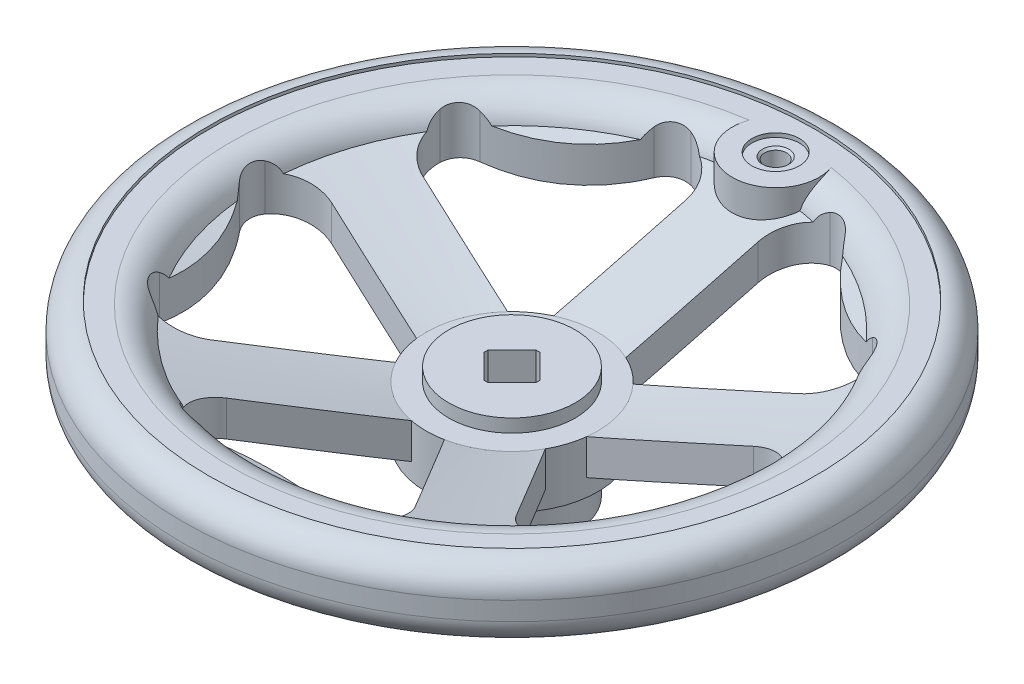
from build123d import *

# Parameters (mm, degrees)
CUT_EXTRUDE1_DEPTH = 65.5
CUT_EXTRUDE2_DEPTH = 65.5
CUT_EXTRUDE3_DEPTH = 65.5
CUT_EXTRUDE4_DEPTH = 65.5
CUT_EXTRUDE5_DEPTH = 65.5
SKETCH7_W          = 32.5
SKETCH7_H          = 20
SKETCH8_W          = 16.5
SKETCH8_H          = 24
SKETCH9_W          = 9
SKETCH9_H          = 1.5
CUT_EXTRUDE6_DEPTH = 44


with BuildPart() as part:
    # Sketch1 → Revolve1 (revolve)
    with BuildSketch(Plane.XY, mode=Mode.PRIVATE) as revolve1_sk:
        with BuildLine():
            Line((0, 44), (24, 44))
            Line((24, 44), (24, 36.722431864))
            Line((24, 36.722431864), (95.15298206, 55.787815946))
            ThreePointArc((95.15298206, 55.787815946), (99.482496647, 61.974286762), (106.65, 64.35))
            Line((106.65, 64.35), (115, 64.35))
            Line((115, 64.35), (115, 65.5))
            ThreePointArc((115, 65.5), (122.071067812, 62.571067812), (125, 55.5))
            Line((125, 55.5), (125, 48.5))
            ThreePointArc((125, 48.5), (122.071067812, 41.428932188), (115, 38.5))
            Line((115, 38.5), (115, 40.35))
            Line((115, 40.35), (105.77, 40.35))
            ThreePointArc((105.77, 40.35), (104.493552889, 40.515676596), (103.301696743, 41.001726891))
            Line((103.301696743, 41.001726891), (99.1, 43.386825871))
            Line((99.1, 43.386825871), (24, 23.263841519))
            Line((24, 23.263841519), (24, 1.5))
            Line((24, 1.5), (22.5, 0))
            Line((22.5, 0), (0, 0))
            Line((0, 0), (0, 44))
        make_face()
    revolve(revolve1_sk.sketch.rotate(Axis((0, 0, 0), (0, 1, 0)), 270), axis=Axis((0, 0, 0), (0, 1, 0)))

    # Sketch2 → Cut-Extrude1 (cut)
    with BuildSketch(Plane(origin=(0, 0, 0), x_dir=(1, 0, 0), z_dir=(0, 1, 0))):
        with BuildLine():
            Line((35.753325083, -72.518062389), (5.914643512, -31.448640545))
            ThreePointArc((5.914643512, -31.448640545), (0, -32), (-5.914643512, -31.448640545))
            Line((-5.914643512, -31.448640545), (-35.753325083, -72.518062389))
            ThreePointArc((-35.753325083, -72.518062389), (-38.445307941, -82.449754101), (-34.104010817, -91.779191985))
            ThreePointArc((-34.104010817, -91.779191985), (-29.219082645, -94.46489837), (-23.655336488, -94.118097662))
            ThreePointArc((-23.655336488, -94.118097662), (0, -90), (23.655336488, -94.118097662))
            ThreePointArc((23.655336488, -94.118097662), (29.219082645, -94.46489837), (34.104010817, -91.779191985))
            ThreePointArc((34.104010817, -91.779191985), (38.445307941, -82.449754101), (35.753325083, -72.518062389))
        make_face()
    extrude(amount=CUT_EXTRUDE1_DEPTH, mode=Mode.SUBTRACT)

    # Sketch3 → Cut-Extrude2 (cut)
    with BuildSketch(Plane(origin=(0, 0, 0), x_dir=(1, 0, 0), z_dir=(0, 1, 0))):
        with BuildLine():
            Line((13.7, 79.683622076), (13.7, 28.91902488))
            ThreePointArc((13.7, 28.91902488), (18.809128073, 25.88854382), (23.270094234, 21.965944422))
            Line((23.270094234, 21.965944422), (71.550095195, 37.653067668))
            ThreePointArc((71.550095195, 37.653067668), (79.565656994, 44.105667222), (81.537179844, 54.205091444))
            ThreePointArc((81.537179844, 54.205091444), (79.163808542, 59.249162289), (74.458799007, 62.238882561))
            ThreePointArc((74.458799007, 62.238882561), (52.900672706, 72.811529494), (36.183660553, 90.047398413))
            ThreePointArc((36.183660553, 90.047398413), (31.886339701, 93.598254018), (26.355731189, 94.296760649))
            ThreePointArc((26.355731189, 94.296760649), (17.359842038, 89.300837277), (13.7, 79.683622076))
        make_face()
    extrude(amount=CUT_EXTRUDE2_DEPTH, mode=Mode.SUBTRACT)

    # Sketch4 → Cut-Extrude3 (cut)
    with BuildSketch(Plane(origin=(0, 0, 0), x_dir=(1, 0, 0), z_dir=(0, 1, 0))):
        with BuildLine():
            Line((-57.920390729, -56.412746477), (-28.081709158, -15.343324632))
            ThreePointArc((-28.081709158, -15.343324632), (-30.433808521, -9.88854382), (-31.73715988, -4.093004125))
            Line((-31.73715988, -4.093004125), (-80.017160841, 11.594119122))
            ThreePointArc((-80.017160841, 11.594119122), (-90.294629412, 11.085285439), (-97.825917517, 4.073511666))
            ThreePointArc((-97.825917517, 4.073511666), (-98.870650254, -1.402260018), (-96.821531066, -6.586529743))
            ThreePointArc((-96.821531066, -6.586529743), (-85.595086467, -27.811529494), (-82.201729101, -51.581653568))
            ThreePointArc((-82.201729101, -51.581653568), (-80.812264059, -56.980257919), (-76.748479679, -60.796171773))
            ThreePointArc((-76.748479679, -60.796171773), (-66.534122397, -62.042035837), (-57.920390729, -56.412746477))
        make_face()
    extrude(amount=CUT_EXTRUDE3_DEPTH, mode=Mode.SUBTRACT)

    # Sketch5 → Cut-Extrude4 (cut)
    with BuildSketch(Plane(origin=(0, 0, 0), x_dir=(1, 0, 0), z_dir=(0, 1, 0))):
        with BuildLine():
            Line((80.017160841, 11.594119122), (31.73715988, -4.093004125))
            ThreePointArc((31.73715988, -4.093004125), (30.433808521, -9.88854382), (28.081709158, -15.343324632))
            Line((28.081709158, -15.343324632), (57.920390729, -56.412746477))
            ThreePointArc((57.920390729, -56.412746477), (66.534122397, -62.042035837), (76.748479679, -60.796171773))
            ThreePointArc((76.748479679, -60.796171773), (80.812264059, -56.980257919), (82.201729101, -51.581653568))
            ThreePointArc((82.201729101, -51.581653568), (85.595086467, -27.811529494), (96.821531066, -6.586529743))
            ThreePointArc((96.821531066, -6.586529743), (98.870650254, -1.402260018), (97.825917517, 4.073511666))
            ThreePointArc((97.825917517, 4.073511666), (90.294629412, 11.085285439), (80.017160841, 11.594119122))
        make_face()
    extrude(amount=CUT_EXTRUDE4_DEPTH, mode=Mode.SUBTRACT)

    # Sketch6 → Cut-Extrude5 (cut)
    with BuildSketch(Plane(origin=(0, 0, 0), x_dir=(1, 0, 0), z_dir=(0, 1, 0))):
        with BuildLine():
            Line((-71.550095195, 37.653067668), (-23.270094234, 21.965944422))
            ThreePointArc((-23.270094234, 21.965944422), (-18.809128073, 25.88854382), (-13.7, 28.91902488))
            Line((-13.7, 28.91902488), (-13.7, 79.683622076))
            ThreePointArc((-13.7, 79.683622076), (-17.359842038, 89.300837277), (-26.355731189, 94.296760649))
            ThreePointArc((-26.355731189, 94.296760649), (-31.886339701, 93.598254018), (-36.183660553, 90.047398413))
            ThreePointArc((-36.183660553, 90.047398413), (-52.900672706, 72.811529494), (-74.458799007, 62.238882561))
            ThreePointArc((-74.458799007, 62.238882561), (-79.163808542, 59.249162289), (-81.537179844, 54.205091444))
            ThreePointArc((-81.537179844, 54.205091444), (-79.565656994, 44.105667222), (-71.550095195, 37.653067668))
        make_face()
    extrude(amount=CUT_EXTRUDE5_DEPTH, mode=Mode.SUBTRACT)

    # Sketch7 → Revolve2 (revolve)
    with BuildSketch(Plane.XY, mode=Mode.PRIVATE) as revolve2_sk:
        with Locations((16.25, 29)):
            Rectangle(SKETCH7_W, SKETCH7_H)
    revolve(revolve2_sk.sketch.rotate(Axis((0, 0, 0), (0, 1, 0)), 270), axis=Axis((0, 0, 0), (0, 1, 0)))

    # Sketch8 → Revolve3 (revolve)
    with BuildSketch(Plane(origin=(0, 0, 0), x_dir=(0, 0, -1), z_dir=(1, 0, 0))):
        with Locations((108.25, 52.35)):
            Rectangle(SKETCH8_W, SKETCH8_H)
    revolve(axis=Axis((0, -50, -100), (0, 1, 0)))

    # Sketch9 → Cut-Revolve1 (revolve, cut)
    with BuildSketch(Plane(origin=(0, 0, 0), x_dir=(0, 0, -1), z_dir=(1, 0, 0)), mode=Mode.PRIVATE) as cut_revolve1_sk:
        with Locations((104.5, 63.6)):
            Rectangle(SKETCH9_W, SKETCH9_H)
    revolve(cut_revolve1_sk.sketch.rotate(Axis((0, -50, -100), (0, 1, 0)), 180), axis=Axis((0, -50, -100), (0, 1, 0)), mode=Mode.SUBTRACT)

    # Sketch10 → Cut-Extrude6 (cut)
    with BuildSketch(Plane(origin=(0, 0, 0), x_dir=(1, 0, 0), z_dir=(0, 1, 0))):
        Polygon((-9.899494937, 0.707106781), (-9.899494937, -0.707106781), (-0.707106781, -9.899494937), (0.707106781, -9.899494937), (9.899494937, -0.707106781), (9.899494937, 0.707106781), (0.707106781, 9.899494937), (-0.707106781, 9.899494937), align=None)
    extrude(amount=CUT_EXTRUDE6_DEPTH, mode=Mode.SUBTRACT)

    # Sketch11 → Cut-Revolve2 (revolve, cut)
    with BuildSketch(Plane(origin=(0, 0, 0), x_dir=(0, 0, -1), z_dir=(1, 0, 0)), mode=Mode.PRIVATE) as cut_revolve2_sk:
        Polygon((100, 62.85), (105, 62.85), (104.188, 62.038), (104.188, 40.35), (100, 40.35), align=None)
    revolve(cut_revolve2_sk.sketch.rotate(Axis((0, 40.35, -100), (0, 1, 0)), 180), axis=Axis((0, 40.35, -100), (0, 1, 0)), mode=Mode.SUBTRACT)


solid = part.part
